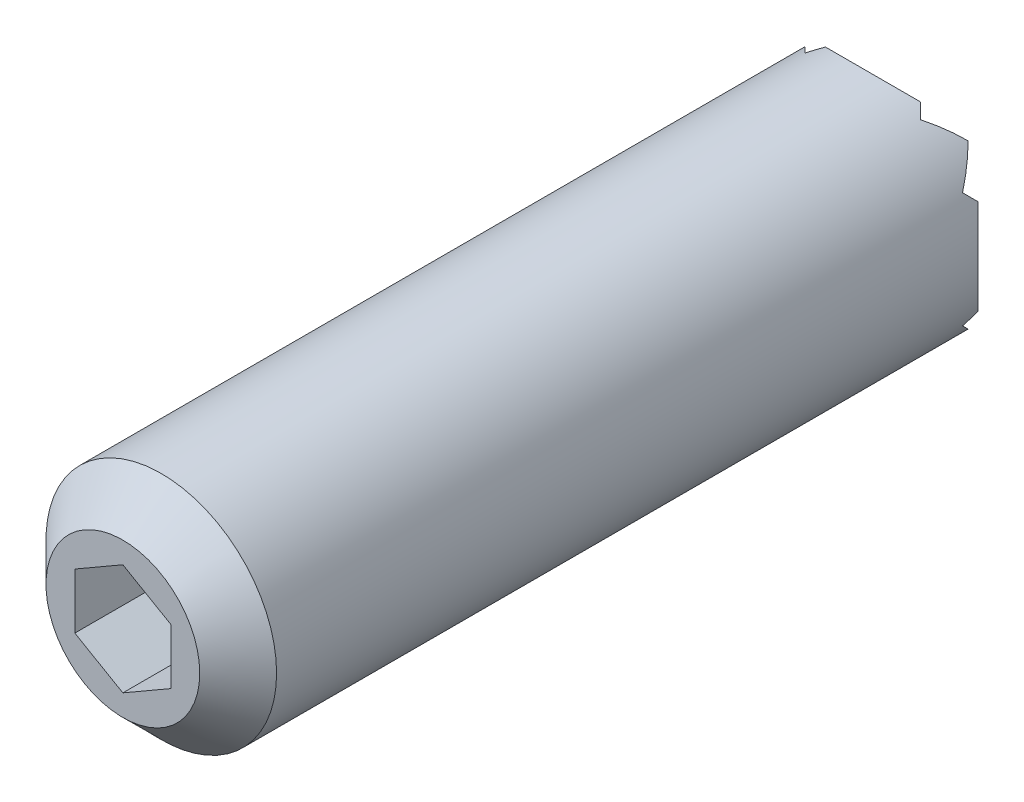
ISO-10303-21;
HEADER;
FILE_DESCRIPTION(('STEP AP214'),'2;1');
FILE_NAME('part.step','',(''),(''),'','','');
FILE_SCHEMA(('AUTOMOTIVE_DESIGN { 1 0 10303 214 1 1 1 1 }'));
ENDSEC;
DATA;
#1=APPLICATION_CONTEXT('core data for automotive mechanical design processes');
#2=APPLICATION_PROTOCOL_DEFINITION('international standard','automotive_design',2000,#1);
#3=PRODUCT_CONTEXT('',#1,'mechanical');
#4=PRODUCT('Part','Part','',(#3));
#5=PRODUCT_RELATED_PRODUCT_CATEGORY('part','',(#4));
#6=PRODUCT_DEFINITION_FORMATION('','',#4);
#7=PRODUCT_DEFINITION_CONTEXT('part definition',#1,'design');
#8=PRODUCT_DEFINITION('design','',#6,#7);
#9=PRODUCT_DEFINITION_SHAPE('','',#8);
#10=(LENGTH_UNIT() NAMED_UNIT(*) SI_UNIT(.MILLI.,.METRE.));
#11=(NAMED_UNIT(*) PLANE_ANGLE_UNIT() SI_UNIT($,.RADIAN.));
#12=(NAMED_UNIT(*) SI_UNIT($,.STERADIAN.) SOLID_ANGLE_UNIT());
#13=UNCERTAINTY_MEASURE_WITH_UNIT(LENGTH_MEASURE(1.E-05),#10,'distance_accuracy_value','');
#14=(GEOMETRIC_REPRESENTATION_CONTEXT(3) GLOBAL_UNCERTAINTY_ASSIGNED_CONTEXT((#13)) GLOBAL_UNIT_ASSIGNED_CONTEXT((#10,
#11,#12)) REPRESENTATION_CONTEXT('',''));
#15=CARTESIAN_POINT('',(0.,0.,0.));
#16=DIRECTION('',(0.,0.,1.));
#17=DIRECTION('',(1.,0.,0.));
#18=AXIS2_PLACEMENT_3D('',#15,#16,#17);
#19=CARTESIAN_POINT('',(2.99999999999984,-10.,1.5));
#20=DIRECTION('',(-0.707106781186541,0.,0.707106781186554));
#21=DIRECTION('',(0.707106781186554,0.,0.707106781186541));
#22=AXIS2_PLACEMENT_3D('',#19,#20,#21);
#23=PLANE('',#22);
#24=CARTESIAN_POINT('',(0.,0.,-1.5));
#25=DIRECTION('',(-0.707106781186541,0.,0.707106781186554));
#26=DIRECTION('',(0.707106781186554,0.,0.707106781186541));
#27=AXIS2_PLACEMENT_3D('',#24,#25,#26);
#28=ELLIPSE('',#27,8.48528137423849,6.);
#29=CARTESIAN_POINT('',(2.99999999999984,-5.19615242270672,1.5));
#30=VERTEX_POINT('',#29);
#31=CARTESIAN_POINT('',(2.46862696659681,-5.46862696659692,0.968626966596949));
#32=VERTEX_POINT('',#31);
#33=EDGE_CURVE('E361',#30,#32,#28,.F.);
#34=ORIENTED_EDGE('',*,*,#33,.T.);
#35=DIRECTION('',(-0.577350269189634,0.577350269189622,-0.577350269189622));
#36=VECTOR('',#35,1.);
#37=CARTESIAN_POINT('',(4.33333333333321,-7.33333333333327,2.8333333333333));
#38=LINE('',#37,#36);
#39=CARTESIAN_POINT('',(1.49999999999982,-4.5,0.));
#40=VERTEX_POINT('',#39);
#41=EDGE_CURVE('E281',#32,#40,#38,.T.);
#42=ORIENTED_EDGE('',*,*,#41,.T.);
#43=DIRECTION('',(0.577350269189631,0.577350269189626,0.57735026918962));
#44=VECTOR('',#43,1.);
#45=CARTESIAN_POINT('',(0.666666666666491,-5.33333333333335,-0.833333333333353));
#46=LINE('',#45,#44);
#47=CARTESIAN_POINT('',(2.99999999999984,-3.,1.5));
#48=VERTEX_POINT('',#47);
#49=EDGE_CURVE('E422',#40,#48,#46,.T.);
#50=ORIENTED_EDGE('',*,*,#49,.T.);
#51=DIRECTION('',(0.,1.,0.));
#52=VECTOR('',#51,1.);
#53=CARTESIAN_POINT('',(2.99999999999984,-10.,1.5));
#54=LINE('',#53,#52);
#55=EDGE_CURVE('E298',#30,#48,#54,.T.);
#56=ORIENTED_EDGE('',*,*,#55,.F.);
#57=EDGE_LOOP('',(#34,#42,#50,#56));
#58=FACE_BOUND('',#57,.T.);
#59=ADVANCED_FACE('F14',(#58),#23,.F.);
#60=CARTESIAN_POINT('',(-1.50000000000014,-10.,0.));
#61=DIRECTION('',(0.707106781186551,0.,0.707106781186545));
#62=DIRECTION('',(0.707106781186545,0.,-0.707106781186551));
#63=AXIS2_PLACEMENT_3D('',#60,#61,#62);
#64=PLANE('',#63);
#65=DIRECTION('',(0.577350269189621,-0.577350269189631,-0.577350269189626));
#66=VECTOR('',#65,1.);
#67=CARTESIAN_POINT('',(0.333333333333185,-6.33333333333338,-1.83333333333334));
#68=LINE('',#67,#66);
#69=CARTESIAN_POINT('',(-3.00000000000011,-3.,1.5));
#70=VERTEX_POINT('',#69);
#71=CARTESIAN_POINT('',(-1.50000000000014,-4.49999999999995,0.));
#72=VERTEX_POINT('',#71);
#73=EDGE_CURVE('E434',#70,#72,#68,.T.);
#74=ORIENTED_EDGE('',*,*,#73,.T.);
#75=DIRECTION('',(-0.577350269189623,-0.577350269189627,0.577350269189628));
#76=VECTOR('',#75,1.);
#77=CARTESIAN_POINT('',(-3.33333333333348,-6.33333333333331,1.83333333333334));
#78=LINE('',#77,#76);
#79=CARTESIAN_POINT('',(-2.46862696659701,-5.46862696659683,0.968626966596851));
#80=VERTEX_POINT('',#79);
#81=EDGE_CURVE('E9',#72,#80,#78,.T.);
#82=ORIENTED_EDGE('',*,*,#81,.T.);
#83=CARTESIAN_POINT('',(0.,0.,-1.5));
#84=DIRECTION('',(0.707106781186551,0.,0.707106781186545));
#85=DIRECTION('',(-0.707106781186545,0.,0.707106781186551));
#86=AXIS2_PLACEMENT_3D('',#83,#84,#85);
#87=ELLIPSE('',#86,8.48528137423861,6.);
#88=CARTESIAN_POINT('',(-3.00000000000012,-5.19615242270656,1.5));
#89=VERTEX_POINT('',#88);
#90=EDGE_CURVE('E365',#80,#89,#87,.F.);
#91=ORIENTED_EDGE('',*,*,#90,.T.);
#92=DIRECTION('',(0.,1.,0.));
#93=VECTOR('',#92,1.);
#94=CARTESIAN_POINT('',(-3.00000000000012,-10.,1.5));
#95=LINE('',#94,#93);
#96=EDGE_CURVE('E293',#89,#70,#95,.T.);
#97=ORIENTED_EDGE('',*,*,#96,.T.);
#98=EDGE_LOOP('',(#74,#82,#91,#97));
#99=FACE_BOUND('',#98,.T.);
#100=ADVANCED_FACE('F564',(#99),#64,.F.);
#101=CARTESIAN_POINT('',(-3.00000000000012,-10.,1.5));
#102=DIRECTION('',(-0.707106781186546,0.,0.707106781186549));
#103=DIRECTION('',(0.707106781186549,0.,0.707106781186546));
#104=AXIS2_PLACEMENT_3D('',#101,#102,#103);
#105=PLANE('',#104);
#106=CARTESIAN_POINT('',(0.,0.,4.5));
#107=DIRECTION('',(-0.707106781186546,0.,0.707106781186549));
#108=DIRECTION('',(0.707106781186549,0.,0.707106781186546));
#109=AXIS2_PLACEMENT_3D('',#106,#107,#108);
#110=ELLIPSE('',#109,8.48528137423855,6.);
#111=CARTESIAN_POINT('',(-4.24264068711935,-4.24264068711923,0.257359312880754));
#112=VERTEX_POINT('',#111);
#113=EDGE_CURVE('E367',#89,#112,#110,.F.);
#114=ORIENTED_EDGE('',*,*,#113,.T.);
#115=DIRECTION('',(0.577350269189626,0.577350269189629,0.577350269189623));
#116=VECTOR('',#115,1.);
#117=CARTESIAN_POINT('',(-5.33333333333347,-5.33333333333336,-0.833333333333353));
#118=LINE('',#117,#116);
#119=EDGE_CURVE('E436',#112,#70,#118,.T.);
#120=ORIENTED_EDGE('',*,*,#119,.T.);
#121=ORIENTED_EDGE('',*,*,#96,.F.);
#122=EDGE_LOOP('',(#114,#120,#121));
#123=FACE_BOUND('',#122,.T.);
#124=ADVANCED_FACE('F558',(#123),#105,.F.);
#125=CARTESIAN_POINT('',(-4.50000000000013,-10.,0.));
#126=DIRECTION('',(0.707106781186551,0.,0.707106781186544));
#127=DIRECTION('',(0.707106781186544,0.,-0.707106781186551));
#128=AXIS2_PLACEMENT_3D('',#125,#126,#127);
#129=PLANE('',#128);
#130=CARTESIAN_POINT('',(0.,0.,-4.5));
#131=DIRECTION('',(0.707106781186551,0.,0.707106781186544));
#132=DIRECTION('',(-0.707106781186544,0.,0.707106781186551));
#133=AXIS2_PLACEMENT_3D('',#130,#131,#132);
#134=ELLIPSE('',#133,8.48528137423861,6.);
#135=CARTESIAN_POINT('',(-6.00000000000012,0.,1.5));
#136=VERTEX_POINT('',#135);
#137=CARTESIAN_POINT('',(-5.46862696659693,2.46862696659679,0.968626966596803));
#138=VERTEX_POINT('',#137);
#139=EDGE_CURVE('E371',#136,#138,#134,.F.);
#140=ORIENTED_EDGE('',*,*,#139,.T.);
#141=DIRECTION('',(0.57735026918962,-0.577350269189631,-0.577350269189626));
#142=VECTOR('',#141,1.);
#143=CARTESIAN_POINT('',(-0.666666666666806,-2.33333333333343,-3.83333333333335));
#144=LINE('',#143,#142);
#145=CARTESIAN_POINT('',(-4.50000000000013,1.5,0.));
#146=VERTEX_POINT('',#145);
#147=EDGE_CURVE('E249',#138,#146,#144,.T.);
#148=ORIENTED_EDGE('',*,*,#147,.T.);
#149=DIRECTION('',(-0.577350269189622,-0.577350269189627,0.577350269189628));
#150=VECTOR('',#149,1.);
#151=CARTESIAN_POINT('',(-8.33333333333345,-2.33333333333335,3.83333333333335));
#152=LINE('',#151,#150);
#153=EDGE_CURVE('E498',#146,#136,#152,.T.);
#154=ORIENTED_EDGE('',*,*,#153,.T.);
#155=EDGE_LOOP('',(#140,#148,#154));
#156=FACE_BOUND('',#155,.T.);
#157=ADVANCED_FACE('F680',(#156),#129,.F.);
#158=CARTESIAN_POINT('',(5.99999999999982,-10.,1.5));
#159=DIRECTION('',(-0.707106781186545,0.,0.70710678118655));
#160=DIRECTION('',(0.70710678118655,0.,0.707106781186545));
#161=AXIS2_PLACEMENT_3D('',#158,#159,#160);
#162=PLANE('',#161);
#163=DIRECTION('',(-0.577350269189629,0.577350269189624,-0.577350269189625));
#164=VECTOR('',#163,1.);
#165=CARTESIAN_POINT('',(9.33333333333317,-3.33333333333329,4.8333333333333));
#166=LINE('',#165,#164);
#167=CARTESIAN_POINT('',(5.99999999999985,0.,1.5));
#168=VERTEX_POINT('',#167);
#169=CARTESIAN_POINT('',(4.4999999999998,1.49999999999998,0.));
#170=VERTEX_POINT('',#169);
#171=EDGE_CURVE('E480',#168,#170,#166,.T.);
#172=ORIENTED_EDGE('',*,*,#171,.T.);
#173=DIRECTION('',(0.577350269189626,0.577350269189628,0.577350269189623));
#174=VECTOR('',#173,1.);
#175=CARTESIAN_POINT('',(1.66666666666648,-1.3333333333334,-2.83333333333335));
#176=LINE('',#175,#174);
#177=CARTESIAN_POINT('',(5.46862696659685,2.46862696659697,0.968626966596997));
#178=VERTEX_POINT('',#177);
#179=EDGE_CURVE('E246',#170,#178,#176,.T.);
#180=ORIENTED_EDGE('',*,*,#179,.T.);
#181=CARTESIAN_POINT('',(0.,0.,-4.5));
#182=DIRECTION('',(-0.707106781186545,0.,0.70710678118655));
#183=DIRECTION('',(0.70710678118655,0.,0.707106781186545));
#184=AXIS2_PLACEMENT_3D('',#181,#182,#183);
#185=ELLIPSE('',#184,8.48528137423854,6.);
#186=EDGE_CURVE('E237',#178,#168,#185,.F.);
#187=ORIENTED_EDGE('',*,*,#186,.T.);
#188=EDGE_LOOP('',(#172,#180,#187));
#189=FACE_BOUND('',#188,.T.);
#190=ADVANCED_FACE('F501',(#189),#162,.F.);
#191=CARTESIAN_POINT('',(4.49999999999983,-10.,0.));
#192=DIRECTION('',(0.707106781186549,0.,0.707106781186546));
#193=DIRECTION('',(0.707106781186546,0.,-0.707106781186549));
#194=AXIS2_PLACEMENT_3D('',#191,#192,#193);
#195=PLANE('',#194);
#196=ORIENTED_EDGE('',*,*,#55,.T.);
#197=DIRECTION('',(0.577350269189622,-0.577350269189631,-0.577350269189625));
#198=VECTOR('',#197,1.);
#199=CARTESIAN_POINT('',(6.33333333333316,-6.33333333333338,-1.83333333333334));
#200=LINE('',#199,#198);
#201=CARTESIAN_POINT('',(4.24264068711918,-4.24264068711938,0.257359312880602));
#202=VERTEX_POINT('',#201);
#203=EDGE_CURVE('E386',#48,#202,#200,.T.);
#204=ORIENTED_EDGE('',*,*,#203,.T.);
#205=CARTESIAN_POINT('',(0.,0.,4.5));
#206=DIRECTION('',(0.707106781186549,0.,0.707106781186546));
#207=DIRECTION('',(-0.707106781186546,0.,0.707106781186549));
#208=AXIS2_PLACEMENT_3D('',#205,#206,#207);
#209=ELLIPSE('',#208,8.48528137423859,6.);
#210=EDGE_CURVE('E355',#202,#30,#209,.F.);
#211=ORIENTED_EDGE('',*,*,#210,.T.);
#212=EDGE_LOOP('',(#196,#204,#211));
#213=FACE_BOUND('',#212,.T.);
#214=ADVANCED_FACE('F665',(#213),#195,.F.);
#215=CARTESIAN_POINT('',(0.,0.,60.));
#216=DIRECTION('',(0.,0.,1.));
#217=DIRECTION('',(1.,0.,0.));
#218=AXIS2_PLACEMENT_3D('',#215,#216,#217);
#219=CYLINDRICAL_SURFACE('',#218,6.);
#220=CARTESIAN_POINT('',(0.,0.,-1.5));
#221=DIRECTION('',(0.,0.707106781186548,0.707106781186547));
#222=DIRECTION('',(0.,-0.707106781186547,0.707106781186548));
#223=AXIS2_PLACEMENT_3D('',#220,#221,#222);
#224=ELLIPSE('',#223,8.48528137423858,6.);
#225=CARTESIAN_POINT('',(5.46862696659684,-2.46862696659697,0.968626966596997));
#226=VERTEX_POINT('',#225);
#227=CARTESIAN_POINT('',(5.19615242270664,-3.,1.5));
#228=VERTEX_POINT('',#227);
#229=EDGE_CURVE('E445',#226,#228,#224,.F.);
#230=ORIENTED_EDGE('',*,*,#229,.F.);
#231=EDGE_CURVE('E357',#168,#226,#185,.F.);
#232=ORIENTED_EDGE('',*,*,#231,.F.);
#233=ORIENTED_EDGE('',*,*,#186,.F.);
#234=CARTESIAN_POINT('',(0.,0.,-1.5));
#235=DIRECTION('',(0.,-0.707106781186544,0.707106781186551));
#236=DIRECTION('',(0.,0.707106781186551,0.707106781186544));
#237=AXIS2_PLACEMENT_3D('',#234,#235,#236);
#238=ELLIPSE('',#237,8.48528137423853,6.);
#239=CARTESIAN_POINT('',(5.19615242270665,3.,1.5));
#240=VERTEX_POINT('',#239);
#241=EDGE_CURVE('E223',#240,#178,#238,.F.);
#242=ORIENTED_EDGE('',*,*,#241,.F.);
#243=CARTESIAN_POINT('',(0.,0.,4.5));
#244=DIRECTION('',(0.,0.707106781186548,0.707106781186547));
#245=DIRECTION('',(0.,-0.707106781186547,0.707106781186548));
#246=AXIS2_PLACEMENT_3D('',#243,#244,#245);
#247=ELLIPSE('',#246,8.48528137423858,6.);
#248=CARTESIAN_POINT('',(4.24264068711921,4.24264068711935,0.257359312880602));
#249=VERTEX_POINT('',#248);
#250=EDGE_CURVE('E205',#249,#240,#247,.F.);
#251=ORIENTED_EDGE('',*,*,#250,.F.);
#252=CARTESIAN_POINT('',(2.99999999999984,5.19615242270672,1.5));
#253=VERTEX_POINT('',#252);
#254=EDGE_CURVE('E358',#253,#249,#209,.F.);
#255=ORIENTED_EDGE('',*,*,#254,.F.);
#256=CARTESIAN_POINT('',(2.4686269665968,5.46862696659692,0.968626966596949));
#257=VERTEX_POINT('',#256);
#258=EDGE_CURVE('E364',#257,#253,#28,.F.);
#259=ORIENTED_EDGE('',*,*,#258,.F.);
#260=CARTESIAN_POINT('',(0.,0.,-4.5));
#261=DIRECTION('',(0.,-0.707106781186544,0.707106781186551));
#262=DIRECTION('',(0.,0.707106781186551,0.707106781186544));
#263=AXIS2_PLACEMENT_3D('',#260,#261,#262);
#264=ELLIPSE('',#263,8.48528137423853,6.);
#265=CARTESIAN_POINT('',(-1.61329283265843E-13,6.,1.5));
#266=VERTEX_POINT('',#265);
#267=EDGE_CURVE('E276',#266,#257,#264,.F.);
#268=ORIENTED_EDGE('',*,*,#267,.F.);
#269=CARTESIAN_POINT('',(-2.46862696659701,5.46862696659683,0.968626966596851));
#270=VERTEX_POINT('',#269);
#271=EDGE_CURVE('E273',#270,#266,#264,.F.);
#272=ORIENTED_EDGE('',*,*,#271,.F.);
#273=CARTESIAN_POINT('',(-3.00000000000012,5.19615242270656,1.5));
#274=VERTEX_POINT('',#273);
#275=EDGE_CURVE('E368',#274,#270,#87,.F.);
#276=ORIENTED_EDGE('',*,*,#275,.F.);
#277=CARTESIAN_POINT('',(-4.24264068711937,4.2426406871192,0.257359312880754));
#278=VERTEX_POINT('',#277);
#279=EDGE_CURVE('E372',#278,#274,#110,.F.);
#280=ORIENTED_EDGE('',*,*,#279,.F.);
#281=CARTESIAN_POINT('',(-5.19615242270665,3.,1.5));
#282=VERTEX_POINT('',#281);
#283=EDGE_CURVE('E219',#282,#278,#247,.F.);
#284=ORIENTED_EDGE('',*,*,#283,.F.);
#285=EDGE_CURVE('E241',#138,#282,#238,.F.);
#286=ORIENTED_EDGE('',*,*,#285,.F.);
#287=ORIENTED_EDGE('',*,*,#139,.F.);
#288=CARTESIAN_POINT('',(-5.46862696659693,-2.46862696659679,0.968626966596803));
#289=VERTEX_POINT('',#288);
#290=EDGE_CURVE('E374',#289,#136,#134,.F.);
#291=ORIENTED_EDGE('',*,*,#290,.F.);
#292=CARTESIAN_POINT('',(-5.19615242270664,-3.,1.5));
#293=VERTEX_POINT('',#292);
#294=EDGE_CURVE('E447',#293,#289,#224,.F.);
#295=ORIENTED_EDGE('',*,*,#294,.F.);
#296=CARTESIAN_POINT('',(0.,0.,4.5));
#297=DIRECTION('',(0.,-0.707106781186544,0.707106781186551));
#298=DIRECTION('',(0.,0.707106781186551,0.707106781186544));
#299=AXIS2_PLACEMENT_3D('',#296,#297,#298);
#300=ELLIPSE('',#299,8.48528137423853,6.);
#301=EDGE_CURVE('E428',#112,#293,#300,.F.);
#302=ORIENTED_EDGE('',*,*,#301,.F.);
#303=ORIENTED_EDGE('',*,*,#113,.F.);
#304=ORIENTED_EDGE('',*,*,#90,.F.);
#305=CARTESIAN_POINT('',(0.,0.,-4.5));
#306=DIRECTION('',(0.,0.707106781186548,0.707106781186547));
#307=DIRECTION('',(0.,-0.707106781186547,0.707106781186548));
#308=AXIS2_PLACEMENT_3D('',#305,#306,#307);
#309=ELLIPSE('',#308,8.48528137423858,6.);
#310=CARTESIAN_POINT('',(-1.31730563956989E-13,-6.,1.5));
#311=VERTEX_POINT('',#310);
#312=EDGE_CURVE('E286',#311,#80,#309,.F.);
#313=ORIENTED_EDGE('',*,*,#312,.F.);
#314=EDGE_CURVE('E284',#32,#311,#309,.F.);
#315=ORIENTED_EDGE('',*,*,#314,.F.);
#316=ORIENTED_EDGE('',*,*,#33,.F.);
#317=ORIENTED_EDGE('',*,*,#210,.F.);
#318=EDGE_CURVE('E425',#228,#202,#300,.F.);
#319=ORIENTED_EDGE('',*,*,#318,.F.);
#320=EDGE_LOOP('',(#230,#232,#233,#242,#251,#255,#259,#268,#272,#276,#280,#284,#286,#287,#291,
#295,#302,#303,#304,#313,#315,#316,#317,#319));
#321=FACE_BOUND('',#320,.T.);
#322=CARTESIAN_POINT('',(0.,0.,38.));
#323=DIRECTION('',(0.,0.,1.));
#324=DIRECTION('',(1.,0.,0.));
#325=AXIS2_PLACEMENT_3D('',#322,#323,#324);
#326=CIRCLE('',#325,6.);
#327=CARTESIAN_POINT('',(6.,0.,38.));
#328=VERTEX_POINT('',#327);
#329=EDGE_CURVE('E352',#328,#328,#326,.F.);
#330=ORIENTED_EDGE('',*,*,#329,.T.);
#331=EDGE_LOOP('',(#330));
#332=FACE_BOUND('',#331,.T.);
#333=ADVANCED_FACE('F233',(#321,#332),#219,.T.);
#334=CARTESIAN_POINT('',(0.,0.,40.));
#335=DIRECTION('',(0.,0.,1.));
#336=DIRECTION('',(1.,0.,0.));
#337=AXIS2_PLACEMENT_3D('',#334,#335,#336);
#338=PLANE('',#337);
#339=CARTESIAN_POINT('',(0.,0.,40.));
#340=DIRECTION('',(0.,0.,1.));
#341=DIRECTION('',(1.,0.,0.));
#342=AXIS2_PLACEMENT_3D('',#339,#340,#341);
#343=CIRCLE('',#342,4.);
#344=CARTESIAN_POINT('',(4.,0.,40.));
#345=VERTEX_POINT('',#344);
#346=EDGE_CURVE('E349',#345,#345,#343,.T.);
#347=ORIENTED_EDGE('',*,*,#346,.T.);
#348=EDGE_LOOP('',(#347));
#349=FACE_BOUND('',#348,.T.);
#350=DIRECTION('',(0.86602540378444,-0.5,0.));
#351=VECTOR('',#350,1.);
#352=CARTESIAN_POINT('',(-2.5,-1.44337567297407,40.));
#353=LINE('',#352,#351);
#354=CARTESIAN_POINT('',(-2.5,-1.44337567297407,40.));
#355=VERTEX_POINT('',#354);
#356=CARTESIAN_POINT('',(0.,-2.88675134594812,40.));
#357=VERTEX_POINT('',#356);
#358=EDGE_CURVE('E290',#355,#357,#353,.T.);
#359=ORIENTED_EDGE('',*,*,#358,.F.);
#360=DIRECTION('',(0.,-1.,0.));
#361=VECTOR('',#360,1.);
#362=CARTESIAN_POINT('',(-2.5,1.44337567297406,40.));
#363=LINE('',#362,#361);
#364=CARTESIAN_POINT('',(-2.5,1.44337567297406,40.));
#365=VERTEX_POINT('',#364);
#366=EDGE_CURVE('E315',#365,#355,#363,.T.);
#367=ORIENTED_EDGE('',*,*,#366,.F.);
#368=DIRECTION('',(0.866025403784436,0.5,0.));
#369=VECTOR('',#368,1.);
#370=CARTESIAN_POINT('',(-2.5,1.44337567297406,40.));
#371=LINE('',#370,#369);
#372=CARTESIAN_POINT('',(0.,2.88675134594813,40.));
#373=VERTEX_POINT('',#372);
#374=EDGE_CURVE('E312',#365,#373,#371,.T.);
#375=ORIENTED_EDGE('',*,*,#374,.T.);
#376=DIRECTION('',(-0.866025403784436,0.5,0.));
#377=VECTOR('',#376,1.);
#378=CARTESIAN_POINT('',(2.5,1.44337567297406,40.));
#379=LINE('',#378,#377);
#380=CARTESIAN_POINT('',(2.5,1.44337567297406,40.));
#381=VERTEX_POINT('',#380);
#382=EDGE_CURVE('E309',#381,#373,#379,.T.);
#383=ORIENTED_EDGE('',*,*,#382,.F.);
#384=DIRECTION('',(0.,-1.,0.));
#385=VECTOR('',#384,1.);
#386=CARTESIAN_POINT('',(2.5,1.44337567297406,40.));
#387=LINE('',#386,#385);
#388=CARTESIAN_POINT('',(2.5,-1.44337567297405,40.));
#389=VERTEX_POINT('',#388);
#390=EDGE_CURVE('E306',#381,#389,#387,.T.);
#391=ORIENTED_EDGE('',*,*,#390,.T.);
#392=DIRECTION('',(-0.866025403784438,-0.5,0.));
#393=VECTOR('',#392,1.);
#394=CARTESIAN_POINT('',(2.5,-1.44337567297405,40.));
#395=LINE('',#394,#393);
#396=EDGE_CURVE('E303',#389,#357,#395,.T.);
#397=ORIENTED_EDGE('',*,*,#396,.T.);
#398=EDGE_LOOP('',(#359,#367,#375,#383,#391,#397));
#399=FACE_BOUND('',#398,.T.);
#400=ADVANCED_FACE('F679',(#349,#399),#338,.T.);
#401=CARTESIAN_POINT('',(-2.5,-1.44337567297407,34.));
#402=DIRECTION('',(-0.5,-0.86602540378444,0.));
#403=DIRECTION('',(-0.86602540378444,0.5,0.));
#404=AXIS2_PLACEMENT_3D('',#401,#402,#403);
#405=PLANE('',#404);
#406=DIRECTION('',(0.,0.,1.));
#407=VECTOR('',#406,1.);
#408=CARTESIAN_POINT('',(-2.5,-1.44337567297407,34.));
#409=LINE('',#408,#407);
#410=CARTESIAN_POINT('',(-2.5,-1.44337567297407,34.));
#411=VERTEX_POINT('',#410);
#412=EDGE_CURVE('E347',#411,#355,#409,.T.);
#413=ORIENTED_EDGE('',*,*,#412,.T.);
#414=ORIENTED_EDGE('',*,*,#358,.T.);
#415=DIRECTION('',(0.,0.,1.));
#416=VECTOR('',#415,1.);
#417=CARTESIAN_POINT('',(0.,-2.88675134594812,34.));
#418=LINE('',#417,#416);
#419=CARTESIAN_POINT('',(0.,-2.88675134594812,34.));
#420=VERTEX_POINT('',#419);
#421=EDGE_CURVE('E336',#420,#357,#418,.T.);
#422=ORIENTED_EDGE('',*,*,#421,.F.);
#423=DIRECTION('',(0.86602540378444,-0.5,0.));
#424=VECTOR('',#423,1.);
#425=CARTESIAN_POINT('',(-2.5,-1.44337567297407,34.));
#426=LINE('',#425,#424);
#427=EDGE_CURVE('E318',#411,#420,#426,.T.);
#428=ORIENTED_EDGE('',*,*,#427,.F.);
#429=EDGE_LOOP('',(#413,#414,#422,#428));
#430=FACE_BOUND('',#429,.T.);
#431=ADVANCED_FACE('F1125',(#430),#405,.F.);
#432=CARTESIAN_POINT('',(-2.5,1.44337567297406,34.));
#433=DIRECTION('',(-1.,0.,0.));
#434=DIRECTION('',(0.,1.,0.));
#435=AXIS2_PLACEMENT_3D('',#432,#433,#434);
#436=PLANE('',#435);
#437=DIRECTION('',(0.,0.,1.));
#438=VECTOR('',#437,1.);
#439=CARTESIAN_POINT('',(-2.5,1.44337567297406,34.));
#440=LINE('',#439,#438);
#441=CARTESIAN_POINT('',(-2.5,1.44337567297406,34.));
#442=VERTEX_POINT('',#441);
#443=EDGE_CURVE('E345',#442,#365,#440,.T.);
#444=ORIENTED_EDGE('',*,*,#443,.T.);
#445=ORIENTED_EDGE('',*,*,#366,.T.);
#446=ORIENTED_EDGE('',*,*,#412,.F.);
#447=DIRECTION('',(0.,-1.,0.));
#448=VECTOR('',#447,1.);
#449=CARTESIAN_POINT('',(-2.5,1.44337567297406,34.));
#450=LINE('',#449,#448);
#451=EDGE_CURVE('E333',#442,#411,#450,.T.);
#452=ORIENTED_EDGE('',*,*,#451,.F.);
#453=EDGE_LOOP('',(#444,#445,#446,#452));
#454=FACE_BOUND('',#453,.T.);
#455=ADVANCED_FACE('F1116',(#454),#436,.F.);
#456=CARTESIAN_POINT('',(-2.5,1.44337567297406,34.));
#457=DIRECTION('',(0.5,-0.866025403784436,0.));
#458=DIRECTION('',(-0.866025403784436,-0.5,0.));
#459=AXIS2_PLACEMENT_3D('',#456,#457,#458);
#460=PLANE('',#459);
#461=DIRECTION('',(0.,0.,1.));
#462=VECTOR('',#461,1.);
#463=CARTESIAN_POINT('',(0.,2.88675134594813,34.));
#464=LINE('',#463,#462);
#465=CARTESIAN_POINT('',(0.,2.88675134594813,34.));
#466=VERTEX_POINT('',#465);
#467=EDGE_CURVE('E343',#466,#373,#464,.T.);
#468=ORIENTED_EDGE('',*,*,#467,.T.);
#469=ORIENTED_EDGE('',*,*,#374,.F.);
#470=ORIENTED_EDGE('',*,*,#443,.F.);
#471=DIRECTION('',(0.866025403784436,0.5,0.));
#472=VECTOR('',#471,1.);
#473=CARTESIAN_POINT('',(-2.5,1.44337567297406,34.));
#474=LINE('',#473,#472);
#475=EDGE_CURVE('E330',#442,#466,#474,.T.);
#476=ORIENTED_EDGE('',*,*,#475,.T.);
#477=EDGE_LOOP('',(#468,#469,#470,#476));
#478=FACE_BOUND('',#477,.T.);
#479=ADVANCED_FACE('F1107',(#478),#460,.T.);
#480=CARTESIAN_POINT('',(2.5,1.44337567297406,34.));
#481=DIRECTION('',(0.5,0.866025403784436,0.));
#482=DIRECTION('',(0.866025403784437,-0.5,0.));
#483=AXIS2_PLACEMENT_3D('',#480,#481,#482);
#484=PLANE('',#483);
#485=DIRECTION('',(0.,0.,1.));
#486=VECTOR('',#485,1.);
#487=CARTESIAN_POINT('',(2.5,1.44337567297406,34.));
#488=LINE('',#487,#486);
#489=CARTESIAN_POINT('',(2.5,1.44337567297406,34.));
#490=VERTEX_POINT('',#489);
#491=EDGE_CURVE('E341',#490,#381,#488,.T.);
#492=ORIENTED_EDGE('',*,*,#491,.T.);
#493=ORIENTED_EDGE('',*,*,#382,.T.);
#494=ORIENTED_EDGE('',*,*,#467,.F.);
#495=DIRECTION('',(-0.866025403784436,0.5,0.));
#496=VECTOR('',#495,1.);
#497=CARTESIAN_POINT('',(2.5,1.44337567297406,34.));
#498=LINE('',#497,#496);
#499=EDGE_CURVE('E327',#490,#466,#498,.T.);
#500=ORIENTED_EDGE('',*,*,#499,.F.);
#501=EDGE_LOOP('',(#492,#493,#494,#500));
#502=FACE_BOUND('',#501,.T.);
#503=ADVANCED_FACE('F1098',(#502),#484,.F.);
#504=CARTESIAN_POINT('',(2.5,1.44337567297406,34.));
#505=DIRECTION('',(-1.,0.,0.));
#506=DIRECTION('',(0.,1.,0.));
#507=AXIS2_PLACEMENT_3D('',#504,#505,#506);
#508=PLANE('',#507);
#509=DIRECTION('',(0.,0.,1.));
#510=VECTOR('',#509,1.);
#511=CARTESIAN_POINT('',(2.5,-1.44337567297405,34.));
#512=LINE('',#511,#510);
#513=CARTESIAN_POINT('',(2.5,-1.44337567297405,34.));
#514=VERTEX_POINT('',#513);
#515=EDGE_CURVE('E339',#514,#389,#512,.T.);
#516=ORIENTED_EDGE('',*,*,#515,.T.);
#517=ORIENTED_EDGE('',*,*,#390,.F.);
#518=ORIENTED_EDGE('',*,*,#491,.F.);
#519=DIRECTION('',(0.,-1.,0.));
#520=VECTOR('',#519,1.);
#521=CARTESIAN_POINT('',(2.5,1.44337567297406,34.));
#522=LINE('',#521,#520);
#523=EDGE_CURVE('E324',#490,#514,#522,.T.);
#524=ORIENTED_EDGE('',*,*,#523,.T.);
#525=EDGE_LOOP('',(#516,#517,#518,#524));
#526=FACE_BOUND('',#525,.T.);
#527=ADVANCED_FACE('F1083',(#526),#508,.T.);
#528=CARTESIAN_POINT('',(2.5,-1.44337567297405,34.));
#529=DIRECTION('',(-0.5,0.866025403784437,0.));
#530=DIRECTION('',(0.866025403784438,0.5,0.));
#531=AXIS2_PLACEMENT_3D('',#528,#529,#530);
#532=PLANE('',#531);
#533=DIRECTION('',(-0.866025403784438,-0.5,0.));
#534=VECTOR('',#533,1.);
#535=CARTESIAN_POINT('',(2.5,-1.44337567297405,34.));
#536=LINE('',#535,#534);
#537=EDGE_CURVE('E321',#514,#420,#536,.T.);
#538=ORIENTED_EDGE('',*,*,#537,.T.);
#539=ORIENTED_EDGE('',*,*,#421,.T.);
#540=ORIENTED_EDGE('',*,*,#396,.F.);
#541=ORIENTED_EDGE('',*,*,#515,.F.);
#542=EDGE_LOOP('',(#538,#539,#540,#541));
#543=FACE_BOUND('',#542,.T.);
#544=ADVANCED_FACE('F644',(#543),#532,.T.);
#545=CARTESIAN_POINT('',(-5.,0.,34.));
#546=DIRECTION('',(0.,0.,1.));
#547=DIRECTION('',(1.,0.,0.));
#548=AXIS2_PLACEMENT_3D('',#545,#546,#547);
#549=PLANE('',#548);
#550=ORIENTED_EDGE('',*,*,#427,.T.);
#551=ORIENTED_EDGE('',*,*,#537,.F.);
#552=ORIENTED_EDGE('',*,*,#523,.F.);
#553=ORIENTED_EDGE('',*,*,#499,.T.);
#554=ORIENTED_EDGE('',*,*,#475,.F.);
#555=ORIENTED_EDGE('',*,*,#451,.T.);
#556=EDGE_LOOP('',(#550,#551,#552,#553,#554,#555));
#557=FACE_BOUND('',#556,.T.);
#558=ADVANCED_FACE('F642',(#557),#549,.T.);
#559=CARTESIAN_POINT('',(0.,0.,40.));
#560=DIRECTION('',(0.,0.,-1.));
#561=DIRECTION('',(-1.,0.,0.));
#562=AXIS2_PLACEMENT_3D('',#559,#560,#561);
#563=CONICAL_SURFACE('',#562,4.,0.785398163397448);
#564=ORIENTED_EDGE('',*,*,#329,.F.);
#565=EDGE_LOOP('',(#564));
#566=FACE_BOUND('',#565,.T.);
#567=ORIENTED_EDGE('',*,*,#346,.F.);
#568=EDGE_LOOP('',(#567));
#569=FACE_BOUND('',#568,.T.);
#570=ADVANCED_FACE('F16',(#566,#569),#563,.T.);
#571=DIRECTION('',(-0.577350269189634,0.577350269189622,-0.577350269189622));
#572=VECTOR('',#571,1.);
#573=CARTESIAN_POINT('',(7.3333333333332,-1.33333333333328,5.83333333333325));
#574=LINE('',#573,#572);
#575=CARTESIAN_POINT('',(2.99999999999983,3.,1.5));
#576=VERTEX_POINT('',#575);
#577=CARTESIAN_POINT('',(1.49999999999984,4.5,0.));
#578=VERTEX_POINT('',#577);
#579=EDGE_CURVE('E217',#576,#578,#574,.T.);
#580=ORIENTED_EDGE('',*,*,#579,.T.);
#581=DIRECTION('',(0.577350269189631,0.577350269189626,0.57735026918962));
#582=VECTOR('',#581,1.);
#583=CARTESIAN_POINT('',(-2.33333333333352,0.666666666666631,-3.8333333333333));
#584=LINE('',#583,#582);
#585=EDGE_CURVE('E270',#578,#257,#584,.T.);
#586=ORIENTED_EDGE('',*,*,#585,.T.);
#587=ORIENTED_EDGE('',*,*,#258,.T.);
#588=EDGE_CURVE('E301',#576,#253,#54,.T.);
#589=ORIENTED_EDGE('',*,*,#588,.F.);
#590=EDGE_LOOP('',(#580,#586,#587,#589));
#591=FACE_BOUND('',#590,.T.);
#592=ADVANCED_FACE('F624',(#591),#23,.F.);
#593=ORIENTED_EDGE('',*,*,#275,.T.);
#594=DIRECTION('',(0.577350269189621,-0.577350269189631,-0.577350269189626));
#595=VECTOR('',#594,1.);
#596=CARTESIAN_POINT('',(3.33333333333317,-0.333333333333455,-4.8333333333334));
#597=LINE('',#596,#595);
#598=CARTESIAN_POINT('',(-1.50000000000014,4.5,0.));
#599=VERTEX_POINT('',#598);
#600=EDGE_CURVE('E22',#270,#599,#597,.T.);
#601=ORIENTED_EDGE('',*,*,#600,.T.);
#602=DIRECTION('',(-0.577350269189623,-0.577350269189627,0.577350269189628));
#603=VECTOR('',#602,1.);
#604=CARTESIAN_POINT('',(-6.33333333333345,-0.333333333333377,4.83333333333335));
#605=LINE('',#604,#603);
#606=CARTESIAN_POINT('',(-3.00000000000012,3.,1.5));
#607=VERTEX_POINT('',#606);
#608=EDGE_CURVE('E393',#599,#607,#605,.T.);
#609=ORIENTED_EDGE('',*,*,#608,.T.);
#610=EDGE_CURVE('E297',#607,#274,#95,.T.);
#611=ORIENTED_EDGE('',*,*,#610,.T.);
#612=EDGE_LOOP('',(#593,#601,#609,#611));
#613=FACE_BOUND('',#612,.T.);
#614=ADVANCED_FACE('F392',(#613),#64,.F.);
#615=ORIENTED_EDGE('',*,*,#610,.F.);
#616=DIRECTION('',(-0.577350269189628,0.577350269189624,-0.577350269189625));
#617=VECTOR('',#616,1.);
#618=CARTESIAN_POINT('',(1.3333333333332,-1.33333333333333,5.8333333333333));
#619=LINE('',#618,#617);
#620=EDGE_CURVE('E407',#607,#278,#619,.T.);
#621=ORIENTED_EDGE('',*,*,#620,.T.);
#622=ORIENTED_EDGE('',*,*,#279,.T.);
#623=EDGE_LOOP('',(#615,#621,#622));
#624=FACE_BOUND('',#623,.T.);
#625=ADVANCED_FACE('F640',(#624),#105,.F.);
#626=ORIENTED_EDGE('',*,*,#290,.T.);
#627=DIRECTION('',(0.57735026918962,-0.577350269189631,-0.577350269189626));
#628=VECTOR('',#627,1.);
#629=CARTESIAN_POINT('',(-1.6666666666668,-4.3333333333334,-2.83333333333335));
#630=LINE('',#629,#628);
#631=CARTESIAN_POINT('',(-4.50000000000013,-1.49999999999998,0.));
#632=VERTEX_POINT('',#631);
#633=EDGE_CURVE('E478',#136,#632,#630,.T.);
#634=ORIENTED_EDGE('',*,*,#633,.T.);
#635=DIRECTION('',(-0.577350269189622,-0.577350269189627,0.577350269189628));
#636=VECTOR('',#635,1.);
#637=CARTESIAN_POINT('',(-7.33333333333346,-4.33333333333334,2.83333333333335));
#638=LINE('',#637,#636);
#639=EDGE_CURVE('E458',#632,#289,#638,.T.);
#640=ORIENTED_EDGE('',*,*,#639,.T.);
#641=EDGE_LOOP('',(#626,#634,#640));
#642=FACE_BOUND('',#641,.T.);
#643=ADVANCED_FACE('F791',(#642),#129,.F.);
#644=DIRECTION('',(-0.577350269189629,0.577350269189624,-0.577350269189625));
#645=VECTOR('',#644,1.);
#646=CARTESIAN_POINT('',(8.33333333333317,-5.33333333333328,3.8333333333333));
#647=LINE('',#646,#645);
#648=CARTESIAN_POINT('',(4.49999999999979,-1.5,0.));
#649=VERTEX_POINT('',#648);
#650=EDGE_CURVE('E439',#226,#649,#647,.T.);
#651=ORIENTED_EDGE('',*,*,#650,.T.);
#652=DIRECTION('',(0.577350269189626,0.577350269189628,0.577350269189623));
#653=VECTOR('',#652,1.);
#654=CARTESIAN_POINT('',(2.66666666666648,-3.33333333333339,-1.83333333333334));
#655=LINE('',#654,#653);
#656=EDGE_CURVE('E461',#649,#168,#655,.T.);
#657=ORIENTED_EDGE('',*,*,#656,.T.);
#658=ORIENTED_EDGE('',*,*,#231,.T.);
#659=EDGE_LOOP('',(#651,#657,#658));
#660=FACE_BOUND('',#659,.T.);
#661=ADVANCED_FACE('F663',(#660),#162,.F.);
#662=ORIENTED_EDGE('',*,*,#254,.T.);
#663=DIRECTION('',(-0.577350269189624,-0.577350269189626,0.577350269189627));
#664=VECTOR('',#663,1.);
#665=CARTESIAN_POINT('',(-0.333333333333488,-0.333333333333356,4.8333333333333));
#666=LINE('',#665,#664);
#667=EDGE_CURVE('E211',#249,#576,#666,.T.);
#668=ORIENTED_EDGE('',*,*,#667,.T.);
#669=ORIENTED_EDGE('',*,*,#588,.T.);
#670=EDGE_LOOP('',(#662,#668,#669));
#671=FACE_BOUND('',#670,.T.);
#672=ADVANCED_FACE('F655',(#671),#195,.F.);
#673=CARTESIAN_POINT('',(10.,4.5,0.));
#674=DIRECTION('',(0.,0.707106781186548,0.707106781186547));
#675=DIRECTION('',(0.,0.707106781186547,-0.707106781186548));
#676=AXIS2_PLACEMENT_3D('',#673,#674,#675);
#677=PLANE('',#676);
#678=ORIENTED_EDGE('',*,*,#250,.T.);
#679=DIRECTION('',(-1.,0.,0.));
#680=VECTOR('',#679,1.);
#681=CARTESIAN_POINT('',(10.,3.,1.5));
#682=LINE('',#681,#680);
#683=EDGE_CURVE('E208',#240,#576,#682,.T.);
#684=ORIENTED_EDGE('',*,*,#683,.T.);
#685=ORIENTED_EDGE('',*,*,#667,.F.);
#686=EDGE_LOOP('',(#678,#684,#685));
#687=FACE_BOUND('',#686,.T.);
#688=ADVANCED_FACE('F207',(#687),#677,.F.);
#689=CARTESIAN_POINT('',(10.,3.,1.5));
#690=DIRECTION('',(0.,-0.707106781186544,0.707106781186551));
#691=DIRECTION('',(0.,0.707106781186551,0.707106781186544));
#692=AXIS2_PLACEMENT_3D('',#689,#690,#691);
#693=PLANE('',#692);
#694=ORIENTED_EDGE('',*,*,#241,.T.);
#695=ORIENTED_EDGE('',*,*,#179,.F.);
#696=DIRECTION('',(0.577350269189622,-0.577350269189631,-0.577350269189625));
#697=VECTOR('',#696,1.);
#698=CARTESIAN_POINT('',(8.33333333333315,-2.33333333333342,-3.83333333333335));
#699=LINE('',#698,#697);
#700=EDGE_CURVE('E226',#576,#170,#699,.T.);
#701=ORIENTED_EDGE('',*,*,#700,.F.);
#702=ORIENTED_EDGE('',*,*,#683,.F.);
#703=EDGE_LOOP('',(#694,#695,#701,#702));
#704=FACE_BOUND('',#703,.T.);
#705=ADVANCED_FACE('F221',(#704),#693,.F.);
#706=CARTESIAN_POINT('',(10.,-3.,1.5));
#707=DIRECTION('',(0.,-0.707106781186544,0.707106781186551));
#708=DIRECTION('',(0.,0.707106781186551,0.707106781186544));
#709=AXIS2_PLACEMENT_3D('',#706,#707,#708);
#710=PLANE('',#709);
#711=ORIENTED_EDGE('',*,*,#318,.T.);
#712=ORIENTED_EDGE('',*,*,#203,.F.);
#713=DIRECTION('',(-1.,0.,0.));
#714=VECTOR('',#713,1.);
#715=CARTESIAN_POINT('',(10.,-3.,1.5));
#716=LINE('',#715,#714);
#717=EDGE_CURVE('E532',#228,#48,#716,.T.);
#718=ORIENTED_EDGE('',*,*,#717,.F.);
#719=EDGE_LOOP('',(#711,#712,#718));
#720=FACE_BOUND('',#719,.T.);
#721=ADVANCED_FACE('F671',(#720),#710,.F.);
#722=CARTESIAN_POINT('',(10.,-1.5,0.));
#723=DIRECTION('',(0.,0.707106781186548,0.707106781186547));
#724=DIRECTION('',(0.,0.707106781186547,-0.707106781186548));
#725=AXIS2_PLACEMENT_3D('',#722,#723,#724);
#726=PLANE('',#725);
#727=ORIENTED_EDGE('',*,*,#229,.T.);
#728=ORIENTED_EDGE('',*,*,#717,.T.);
#729=DIRECTION('',(-0.577350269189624,-0.577350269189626,0.577350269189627));
#730=VECTOR('',#729,1.);
#731=CARTESIAN_POINT('',(1.66666666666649,-4.33333333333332,2.8333333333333));
#732=LINE('',#731,#730);
#733=EDGE_CURVE('E383',#649,#48,#732,.T.);
#734=ORIENTED_EDGE('',*,*,#733,.F.);
#735=ORIENTED_EDGE('',*,*,#650,.F.);
#736=EDGE_LOOP('',(#727,#728,#734,#735));
#737=FACE_BOUND('',#736,.T.);
#738=ADVANCED_FACE('F653',(#737),#726,.F.);
#739=DIRECTION('',(0.577350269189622,-0.577350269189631,-0.577350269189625));
#740=VECTOR('',#739,1.);
#741=CARTESIAN_POINT('',(7.33333333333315,-4.3333333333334,-2.83333333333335));
#742=LINE('',#741,#740);
#743=CARTESIAN_POINT('',(2.99999999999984,0.,1.5));
#744=VERTEX_POINT('',#743);
#745=EDGE_CURVE('E380',#744,#649,#742,.T.);
#746=ORIENTED_EDGE('',*,*,#745,.T.);
#747=ORIENTED_EDGE('',*,*,#733,.T.);
#748=EDGE_CURVE('E300',#48,#744,#54,.T.);
#749=ORIENTED_EDGE('',*,*,#748,.T.);
#750=EDGE_LOOP('',(#746,#747,#749));
#751=FACE_BOUND('',#750,.T.);
#752=ADVANCED_FACE('F633',(#751),#195,.F.);
#753=ORIENTED_EDGE('',*,*,#748,.F.);
#754=DIRECTION('',(-0.577350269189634,0.577350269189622,-0.577350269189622));
#755=VECTOR('',#754,1.);
#756=CARTESIAN_POINT('',(5.3333333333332,-5.33333333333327,3.8333333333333));
#757=LINE('',#756,#755);
#758=CARTESIAN_POINT('',(1.49999999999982,-1.5,0.));
#759=VERTEX_POINT('',#758);
#760=EDGE_CURVE('E442',#48,#759,#757,.T.);
#761=ORIENTED_EDGE('',*,*,#760,.T.);
#762=DIRECTION('',(0.577350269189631,0.577350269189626,0.57735026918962));
#763=VECTOR('',#762,1.);
#764=CARTESIAN_POINT('',(-0.333333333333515,-3.33333333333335,-1.83333333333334));
#765=LINE('',#764,#763);
#766=EDGE_CURVE('E464',#759,#744,#765,.T.);
#767=ORIENTED_EDGE('',*,*,#766,.T.);
#768=EDGE_LOOP('',(#753,#761,#767));
#769=FACE_BOUND('',#768,.T.);
#770=ADVANCED_FACE('F623',(#769),#23,.F.);
#771=CARTESIAN_POINT('',(10.,0.,1.5));
#772=DIRECTION('',(0.,-0.707106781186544,0.707106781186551));
#773=DIRECTION('',(0.,0.707106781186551,0.707106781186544));
#774=AXIS2_PLACEMENT_3D('',#771,#772,#773);
#775=PLANE('',#774);
#776=ORIENTED_EDGE('',*,*,#745,.F.);
#777=DIRECTION('',(-1.,0.,0.));
#778=VECTOR('',#777,1.);
#779=CARTESIAN_POINT('',(10.,0.,1.5));
#780=LINE('',#779,#778);
#781=EDGE_CURVE('E523',#168,#744,#780,.T.);
#782=ORIENTED_EDGE('',*,*,#781,.F.);
#783=ORIENTED_EDGE('',*,*,#656,.F.);
#784=EDGE_LOOP('',(#776,#782,#783));
#785=FACE_BOUND('',#784,.T.);
#786=ADVANCED_FACE('F632',(#785),#775,.F.);
#787=CARTESIAN_POINT('',(10.,1.49999999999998,0.));
#788=DIRECTION('',(0.,0.707106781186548,0.707106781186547));
#789=DIRECTION('',(0.,0.707106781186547,-0.707106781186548));
#790=AXIS2_PLACEMENT_3D('',#787,#788,#789);
#791=PLANE('',#790);
#792=ORIENTED_EDGE('',*,*,#781,.T.);
#793=DIRECTION('',(-0.577350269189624,-0.577350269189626,0.577350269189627));
#794=VECTOR('',#793,1.);
#795=CARTESIAN_POINT('',(0.666666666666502,-2.33333333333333,3.8333333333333));
#796=LINE('',#795,#794);
#797=EDGE_CURVE('E377',#170,#744,#796,.T.);
#798=ORIENTED_EDGE('',*,*,#797,.F.);
#799=ORIENTED_EDGE('',*,*,#171,.F.);
#800=EDGE_LOOP('',(#792,#798,#799));
#801=FACE_BOUND('',#800,.T.);
#802=ADVANCED_FACE('F654',(#801),#791,.F.);
#803=ORIENTED_EDGE('',*,*,#700,.T.);
#804=ORIENTED_EDGE('',*,*,#797,.T.);
#805=EDGE_CURVE('E509',#744,#576,#54,.T.);
#806=ORIENTED_EDGE('',*,*,#805,.T.);
#807=EDGE_LOOP('',(#803,#804,#806));
#808=FACE_BOUND('',#807,.T.);
#809=ADVANCED_FACE('F507',(#808),#195,.F.);
#810=ORIENTED_EDGE('',*,*,#805,.F.);
#811=DIRECTION('',(-0.577350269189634,0.577350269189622,-0.577350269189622));
#812=VECTOR('',#811,1.);
#813=CARTESIAN_POINT('',(6.3333333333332,-3.33333333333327,4.83333333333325));
#814=LINE('',#813,#812);
#815=CARTESIAN_POINT('',(1.49999999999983,1.49999999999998,0.));
#816=VERTEX_POINT('',#815);
#817=EDGE_CURVE('E483',#744,#816,#814,.T.);
#818=ORIENTED_EDGE('',*,*,#817,.T.);
#819=DIRECTION('',(0.577350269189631,0.577350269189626,0.57735026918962));
#820=VECTOR('',#819,1.);
#821=CARTESIAN_POINT('',(-1.33333333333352,-1.33333333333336,-2.8333333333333));
#822=LINE('',#821,#820);
#823=EDGE_CURVE('E239',#816,#576,#822,.T.);
#824=ORIENTED_EDGE('',*,*,#823,.T.);
#825=EDGE_LOOP('',(#810,#818,#824));
#826=FACE_BOUND('',#825,.T.);
#827=ADVANCED_FACE('F512',(#826),#23,.F.);
#828=ORIENTED_EDGE('',*,*,#294,.T.);
#829=ORIENTED_EDGE('',*,*,#639,.F.);
#830=DIRECTION('',(-0.577350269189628,0.577350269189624,-0.577350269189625));
#831=VECTOR('',#830,1.);
#832=CARTESIAN_POINT('',(-0.666666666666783,-5.33333333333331,3.8333333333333));
#833=LINE('',#832,#831);
#834=EDGE_CURVE('E455',#70,#632,#833,.T.);
#835=ORIENTED_EDGE('',*,*,#834,.F.);
#836=EDGE_CURVE('E227',#70,#293,#716,.T.);
#837=ORIENTED_EDGE('',*,*,#836,.T.);
#838=EDGE_LOOP('',(#828,#829,#835,#837));
#839=FACE_BOUND('',#838,.T.);
#840=ADVANCED_FACE('F646',(#839),#726,.F.);
#841=ORIENTED_EDGE('',*,*,#301,.T.);
#842=ORIENTED_EDGE('',*,*,#836,.F.);
#843=ORIENTED_EDGE('',*,*,#119,.F.);
#844=EDGE_LOOP('',(#841,#842,#843));
#845=FACE_BOUND('',#844,.T.);
#846=ADVANCED_FACE('F651',(#845),#710,.F.);
#847=CARTESIAN_POINT('',(-3.00000000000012,0.,1.5));
#848=VERTEX_POINT('',#847);
#849=EDGE_CURVE('E527',#848,#136,#780,.T.);
#850=ORIENTED_EDGE('',*,*,#849,.F.);
#851=DIRECTION('',(0.577350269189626,0.577350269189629,0.577350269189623));
#852=VECTOR('',#851,1.);
#853=CARTESIAN_POINT('',(-6.33333333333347,-3.33333333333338,-1.83333333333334));
#854=LINE('',#853,#852);
#855=EDGE_CURVE('E475',#632,#848,#854,.T.);
#856=ORIENTED_EDGE('',*,*,#855,.F.);
#857=ORIENTED_EDGE('',*,*,#633,.F.);
#858=EDGE_LOOP('',(#850,#856,#857));
#859=FACE_BOUND('',#858,.T.);
#860=ADVANCED_FACE('F707',(#859),#775,.F.);
#861=DIRECTION('',(-0.577350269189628,0.577350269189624,-0.577350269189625));
#862=VECTOR('',#861,1.);
#863=CARTESIAN_POINT('',(0.33333333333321,-3.33333333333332,4.8333333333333));
#864=LINE('',#863,#862);
#865=EDGE_CURVE('E495',#848,#146,#864,.T.);
#866=ORIENTED_EDGE('',*,*,#865,.F.);
#867=ORIENTED_EDGE('',*,*,#849,.T.);
#868=ORIENTED_EDGE('',*,*,#153,.F.);
#869=EDGE_LOOP('',(#866,#867,#868));
#870=FACE_BOUND('',#869,.T.);
#871=ADVANCED_FACE('F660',(#870),#791,.F.);
#872=ORIENTED_EDGE('',*,*,#285,.T.);
#873=EDGE_CURVE('E230',#607,#282,#682,.T.);
#874=ORIENTED_EDGE('',*,*,#873,.F.);
#875=DIRECTION('',(0.577350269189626,0.577350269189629,0.577350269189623));
#876=VECTOR('',#875,1.);
#877=CARTESIAN_POINT('',(-7.33333333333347,-1.33333333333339,-2.83333333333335));
#878=LINE('',#877,#876);
#879=EDGE_CURVE('E257',#146,#607,#878,.T.);
#880=ORIENTED_EDGE('',*,*,#879,.F.);
#881=ORIENTED_EDGE('',*,*,#147,.F.);
#882=EDGE_LOOP('',(#872,#874,#880,#881));
#883=FACE_BOUND('',#882,.T.);
#884=ADVANCED_FACE('F719',(#883),#693,.F.);
#885=ORIENTED_EDGE('',*,*,#283,.T.);
#886=ORIENTED_EDGE('',*,*,#620,.F.);
#887=ORIENTED_EDGE('',*,*,#873,.T.);
#888=EDGE_LOOP('',(#885,#886,#887));
#889=FACE_BOUND('',#888,.T.);
#890=ADVANCED_FACE('F612',(#889),#677,.F.);
#891=EDGE_CURVE('E296',#70,#848,#95,.T.);
#892=ORIENTED_EDGE('',*,*,#891,.F.);
#893=ORIENTED_EDGE('',*,*,#834,.T.);
#894=ORIENTED_EDGE('',*,*,#855,.T.);
#895=EDGE_LOOP('',(#892,#893,#894));
#896=FACE_BOUND('',#895,.T.);
#897=ADVANCED_FACE('F569',(#896),#105,.F.);
#898=DIRECTION('',(0.577350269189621,-0.577350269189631,-0.577350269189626));
#899=VECTOR('',#898,1.);
#900=CARTESIAN_POINT('',(1.33333333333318,-4.3333333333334,-2.83333333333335));
#901=LINE('',#900,#899);
#902=CARTESIAN_POINT('',(-1.50000000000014,-1.49999999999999,0.));
#903=VERTEX_POINT('',#902);
#904=EDGE_CURVE('E473',#848,#903,#901,.T.);
#905=ORIENTED_EDGE('',*,*,#904,.T.);
#906=DIRECTION('',(-0.577350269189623,-0.577350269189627,0.577350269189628));
#907=VECTOR('',#906,1.);
#908=CARTESIAN_POINT('',(-4.33333333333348,-4.33333333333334,2.83333333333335));
#909=LINE('',#908,#907);
#910=EDGE_CURVE('E452',#903,#70,#909,.T.);
#911=ORIENTED_EDGE('',*,*,#910,.T.);
#912=ORIENTED_EDGE('',*,*,#891,.T.);
#913=EDGE_LOOP('',(#905,#911,#912));
#914=FACE_BOUND('',#913,.T.);
#915=ADVANCED_FACE('F574',(#914),#64,.F.);
#916=EDGE_CURVE('E573',#848,#607,#95,.T.);
#917=ORIENTED_EDGE('',*,*,#916,.F.);
#918=ORIENTED_EDGE('',*,*,#865,.T.);
#919=ORIENTED_EDGE('',*,*,#879,.T.);
#920=EDGE_LOOP('',(#917,#918,#919));
#921=FACE_BOUND('',#920,.T.);
#922=ADVANCED_FACE('F769',(#921),#105,.F.);
#923=DIRECTION('',(0.577350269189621,-0.577350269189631,-0.577350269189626));
#924=VECTOR('',#923,1.);
#925=CARTESIAN_POINT('',(2.33333333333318,-2.33333333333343,-3.83333333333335));
#926=LINE('',#925,#924);
#927=CARTESIAN_POINT('',(-1.50000000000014,1.49999999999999,0.));
#928=VERTEX_POINT('',#927);
#929=EDGE_CURVE('E264',#607,#928,#926,.T.);
#930=ORIENTED_EDGE('',*,*,#929,.T.);
#931=DIRECTION('',(-0.577350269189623,-0.577350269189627,0.577350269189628));
#932=VECTOR('',#931,1.);
#933=CARTESIAN_POINT('',(-5.33333333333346,-2.33333333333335,3.83333333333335));
#934=LINE('',#933,#932);
#935=EDGE_CURVE('E492',#928,#848,#934,.T.);
#936=ORIENTED_EDGE('',*,*,#935,.T.);
#937=ORIENTED_EDGE('',*,*,#916,.T.);
#938=EDGE_LOOP('',(#930,#936,#937));
#939=FACE_BOUND('',#938,.T.);
#940=ADVANCED_FACE('F641',(#939),#64,.F.);
#941=DIRECTION('',(-0.577350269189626,0.577350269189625,-0.577350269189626));
#942=VECTOR('',#941,1.);
#943=CARTESIAN_POINT('',(4.33333333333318,-1.33333333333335,5.8333333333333));
#944=LINE('',#943,#942);
#945=CARTESIAN_POINT('',(-1.50920942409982E-13,3.,1.5));
#946=VERTEX_POINT('',#945);
#947=EDGE_CURVE('E403',#946,#599,#944,.T.);
#948=ORIENTED_EDGE('',*,*,#947,.F.);
#949=EDGE_CURVE('E405',#946,#607,#682,.T.);
#950=ORIENTED_EDGE('',*,*,#949,.T.);
#951=ORIENTED_EDGE('',*,*,#608,.F.);
#952=EDGE_LOOP('',(#948,#950,#951));
#953=FACE_BOUND('',#952,.T.);
#954=ADVANCED_FACE('F401',(#953),#677,.F.);
#955=ORIENTED_EDGE('',*,*,#949,.F.);
#956=DIRECTION('',(0.577350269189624,0.577350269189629,0.577350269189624));
#957=VECTOR('',#956,1.);
#958=CARTESIAN_POINT('',(-4.33333333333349,-1.3333333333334,-2.83333333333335));
#959=LINE('',#958,#957);
#960=EDGE_CURVE('E243',#928,#946,#959,.T.);
#961=ORIENTED_EDGE('',*,*,#960,.F.);
#962=ORIENTED_EDGE('',*,*,#929,.F.);
#963=EDGE_LOOP('',(#955,#961,#962));
#964=FACE_BOUND('',#963,.T.);
#965=ADVANCED_FACE('F724',(#964),#693,.F.);
#966=CARTESIAN_POINT('',(10.,6.,1.5));
#967=DIRECTION('',(0.,-0.707106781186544,0.707106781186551));
#968=DIRECTION('',(0.,0.707106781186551,0.707106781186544));
#969=AXIS2_PLACEMENT_3D('',#966,#967,#968);
#970=PLANE('',#969);
#971=ORIENTED_EDGE('',*,*,#271,.T.);
#972=DIRECTION('',(0.577350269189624,0.577350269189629,0.577350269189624));
#973=VECTOR('',#972,1.);
#974=CARTESIAN_POINT('',(-5.33333333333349,0.666666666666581,-3.83333333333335));
#975=LINE('',#974,#973);
#976=EDGE_CURVE('E248',#599,#266,#975,.T.);
#977=ORIENTED_EDGE('',*,*,#976,.F.);
#978=ORIENTED_EDGE('',*,*,#600,.F.);
#979=EDGE_LOOP('',(#971,#977,#978));
#980=FACE_BOUND('',#979,.T.);
#981=ADVANCED_FACE('F409',(#980),#970,.F.);
#982=CARTESIAN_POINT('',(10.,-4.5,0.));
#983=DIRECTION('',(0.,0.707106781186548,0.707106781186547));
#984=DIRECTION('',(0.,0.707106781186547,-0.707106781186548));
#985=AXIS2_PLACEMENT_3D('',#982,#983,#984);
#986=PLANE('',#985);
#987=ORIENTED_EDGE('',*,*,#312,.T.);
#988=ORIENTED_EDGE('',*,*,#81,.F.);
#989=DIRECTION('',(-0.577350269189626,0.577350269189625,-0.577350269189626));
#990=VECTOR('',#989,1.);
#991=CARTESIAN_POINT('',(1.33333333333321,-7.3333333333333,2.83333333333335));
#992=LINE('',#991,#990);
#993=EDGE_CURVE('E277',#311,#72,#992,.T.);
#994=ORIENTED_EDGE('',*,*,#993,.F.);
#995=EDGE_LOOP('',(#987,#988,#994));
#996=FACE_BOUND('',#995,.T.);
#997=ADVANCED_FACE('F708',(#996),#986,.F.);
#998=CARTESIAN_POINT('',(-1.38994718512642E-13,-3.,1.5));
#999=VERTEX_POINT('',#998);
#1000=EDGE_CURVE('E541',#999,#70,#716,.T.);
#1001=ORIENTED_EDGE('',*,*,#1000,.F.);
#1002=DIRECTION('',(0.577350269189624,0.577350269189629,0.577350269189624));
#1003=VECTOR('',#1002,1.);
#1004=CARTESIAN_POINT('',(-2.33333333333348,-5.33333333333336,-0.833333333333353));
#1005=LINE('',#1004,#1003);
#1006=EDGE_CURVE('E431',#72,#999,#1005,.T.);
#1007=ORIENTED_EDGE('',*,*,#1006,.F.);
#1008=ORIENTED_EDGE('',*,*,#73,.F.);
#1009=EDGE_LOOP('',(#1001,#1007,#1008));
#1010=FACE_BOUND('',#1009,.T.);
#1011=ADVANCED_FACE('F702',(#1010),#710,.F.);
#1012=DIRECTION('',(-0.577350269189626,0.577350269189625,-0.577350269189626));
#1013=VECTOR('',#1012,1.);
#1014=CARTESIAN_POINT('',(2.33333333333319,-5.33333333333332,3.8333333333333));
#1015=LINE('',#1014,#1013);
#1016=EDGE_CURVE('E449',#999,#903,#1015,.T.);
#1017=ORIENTED_EDGE('',*,*,#1016,.F.);
#1018=ORIENTED_EDGE('',*,*,#1000,.T.);
#1019=ORIENTED_EDGE('',*,*,#910,.F.);
#1020=EDGE_LOOP('',(#1017,#1018,#1019));
#1021=FACE_BOUND('',#1020,.T.);
#1022=ADVANCED_FACE('F550',(#1021),#726,.F.);
#1023=CARTESIAN_POINT('',(-1.44632569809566E-13,0.,1.5));
#1024=VERTEX_POINT('',#1023);
#1025=EDGE_CURVE('E530',#1024,#848,#780,.T.);
#1026=ORIENTED_EDGE('',*,*,#1025,.F.);
#1027=DIRECTION('',(0.577350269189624,0.577350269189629,0.577350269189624));
#1028=VECTOR('',#1027,1.);
#1029=CARTESIAN_POINT('',(-3.33333333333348,-3.33333333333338,-1.83333333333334));
#1030=LINE('',#1029,#1028);
#1031=EDGE_CURVE('E470',#903,#1024,#1030,.T.);
#1032=ORIENTED_EDGE('',*,*,#1031,.F.);
#1033=ORIENTED_EDGE('',*,*,#904,.F.);
#1034=EDGE_LOOP('',(#1026,#1032,#1033));
#1035=FACE_BOUND('',#1034,.T.);
#1036=ADVANCED_FACE('F577',(#1035),#775,.F.);
#1037=DIRECTION('',(-0.577350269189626,0.577350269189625,-0.577350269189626));
#1038=VECTOR('',#1037,1.);
#1039=CARTESIAN_POINT('',(3.33333333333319,-3.33333333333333,4.8333333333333));
#1040=LINE('',#1039,#1038);
#1041=EDGE_CURVE('E489',#1024,#928,#1040,.T.);
#1042=ORIENTED_EDGE('',*,*,#1041,.F.);
#1043=ORIENTED_EDGE('',*,*,#1025,.T.);
#1044=ORIENTED_EDGE('',*,*,#935,.F.);
#1045=EDGE_LOOP('',(#1042,#1043,#1044));
#1046=FACE_BOUND('',#1045,.T.);
#1047=ADVANCED_FACE('F581',(#1046),#791,.F.);
#1048=CARTESIAN_POINT('',(-1.42228365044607E-13,-10.,1.5));
#1049=DIRECTION('',(-0.707106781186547,0.,0.707106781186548));
#1050=DIRECTION('',(0.707106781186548,0.,0.707106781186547));
#1051=AXIS2_PLACEMENT_3D('',#1048,#1049,#1050);
#1052=PLANE('',#1051);
#1053=ORIENTED_EDGE('',*,*,#947,.T.);
#1054=ORIENTED_EDGE('',*,*,#976,.T.);
#1055=DIRECTION('',(0.,1.,0.));
#1056=VECTOR('',#1055,1.);
#1057=CARTESIAN_POINT('',(-1.42228365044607E-13,-10.,1.5));
#1058=LINE('',#1057,#1056);
#1059=EDGE_CURVE('E292',#946,#266,#1058,.T.);
#1060=ORIENTED_EDGE('',*,*,#1059,.F.);
#1061=EDGE_LOOP('',(#1053,#1054,#1060));
#1062=FACE_BOUND('',#1061,.T.);
#1063=ADVANCED_FACE('F413',(#1062),#1052,.F.);
#1064=CARTESIAN_POINT('',(1.49999999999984,-10.,0.));
#1065=DIRECTION('',(0.707106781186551,0.,0.707106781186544));
#1066=DIRECTION('',(0.707106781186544,0.,-0.707106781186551));
#1067=AXIS2_PLACEMENT_3D('',#1064,#1065,#1066);
#1068=PLANE('',#1067);
#1069=ORIENTED_EDGE('',*,*,#1059,.T.);
#1070=DIRECTION('',(0.57735026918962,-0.577350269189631,-0.577350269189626));
#1071=VECTOR('',#1070,1.);
#1072=CARTESIAN_POINT('',(6.33333333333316,-0.333333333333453,-4.83333333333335));
#1073=LINE('',#1072,#1071);
#1074=EDGE_CURVE('E255',#266,#578,#1073,.T.);
#1075=ORIENTED_EDGE('',*,*,#1074,.T.);
#1076=DIRECTION('',(-0.577350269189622,-0.577350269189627,0.577350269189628));
#1077=VECTOR('',#1076,1.);
#1078=CARTESIAN_POINT('',(-3.33333333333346,-0.333333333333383,4.83333333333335));
#1079=LINE('',#1078,#1077);
#1080=EDGE_CURVE('E216',#578,#946,#1079,.T.);
#1081=ORIENTED_EDGE('',*,*,#1080,.T.);
#1082=EDGE_LOOP('',(#1069,#1075,#1081));
#1083=FACE_BOUND('',#1082,.T.);
#1084=ADVANCED_FACE('F605',(#1083),#1068,.F.);
#1085=EDGE_CURVE('E287',#311,#999,#1058,.T.);
#1086=ORIENTED_EDGE('',*,*,#1085,.F.);
#1087=ORIENTED_EDGE('',*,*,#993,.T.);
#1088=ORIENTED_EDGE('',*,*,#1006,.T.);
#1089=EDGE_LOOP('',(#1086,#1087,#1088));
#1090=FACE_BOUND('',#1089,.T.);
#1091=ADVANCED_FACE('F616',(#1090),#1052,.F.);
#1092=DIRECTION('',(0.57735026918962,-0.577350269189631,-0.577350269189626));
#1093=VECTOR('',#1092,1.);
#1094=CARTESIAN_POINT('',(3.33333333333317,-6.33333333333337,-1.83333333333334));
#1095=LINE('',#1094,#1093);
#1096=EDGE_CURVE('E427',#999,#40,#1095,.T.);
#1097=ORIENTED_EDGE('',*,*,#1096,.T.);
#1098=DIRECTION('',(-0.577350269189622,-0.577350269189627,0.577350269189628));
#1099=VECTOR('',#1098,1.);
#1100=CARTESIAN_POINT('',(-0.333333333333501,-6.33333333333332,1.83333333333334));
#1101=LINE('',#1100,#1099);
#1102=EDGE_CURVE('E37',#40,#311,#1101,.T.);
#1103=ORIENTED_EDGE('',*,*,#1102,.T.);
#1104=ORIENTED_EDGE('',*,*,#1085,.T.);
#1105=EDGE_LOOP('',(#1097,#1103,#1104));
#1106=FACE_BOUND('',#1105,.T.);
#1107=ADVANCED_FACE('F618',(#1106),#1068,.F.);
#1108=EDGE_CURVE('E291',#999,#1024,#1058,.T.);
#1109=ORIENTED_EDGE('',*,*,#1108,.F.);
#1110=ORIENTED_EDGE('',*,*,#1016,.T.);
#1111=ORIENTED_EDGE('',*,*,#1031,.T.);
#1112=EDGE_LOOP('',(#1109,#1110,#1111));
#1113=FACE_BOUND('',#1112,.T.);
#1114=ADVANCED_FACE('F596',(#1113),#1052,.F.);
#1115=DIRECTION('',(0.57735026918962,-0.577350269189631,-0.577350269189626));
#1116=VECTOR('',#1115,1.);
#1117=CARTESIAN_POINT('',(4.33333333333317,-4.3333333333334,-2.83333333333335));
#1118=LINE('',#1117,#1116);
#1119=EDGE_CURVE('E467',#1024,#759,#1118,.T.);
#1120=ORIENTED_EDGE('',*,*,#1119,.T.);
#1121=DIRECTION('',(-0.577350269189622,-0.577350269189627,0.577350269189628));
#1122=VECTOR('',#1121,1.);
#1123=CARTESIAN_POINT('',(-1.33333333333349,-4.33333333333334,2.83333333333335));
#1124=LINE('',#1123,#1122);
#1125=EDGE_CURVE('E29',#759,#999,#1124,.T.);
#1126=ORIENTED_EDGE('',*,*,#1125,.T.);
#1127=ORIENTED_EDGE('',*,*,#1108,.T.);
#1128=EDGE_LOOP('',(#1120,#1126,#1127));
#1129=FACE_BOUND('',#1128,.T.);
#1130=ADVANCED_FACE('F597',(#1129),#1068,.F.);
#1131=EDGE_CURVE('E598',#1024,#946,#1058,.T.);
#1132=ORIENTED_EDGE('',*,*,#1131,.F.);
#1133=ORIENTED_EDGE('',*,*,#1041,.T.);
#1134=ORIENTED_EDGE('',*,*,#960,.T.);
#1135=EDGE_LOOP('',(#1132,#1133,#1134));
#1136=FACE_BOUND('',#1135,.T.);
#1137=ADVANCED_FACE('F599',(#1136),#1052,.F.);
#1138=DIRECTION('',(0.57735026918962,-0.577350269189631,-0.577350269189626));
#1139=VECTOR('',#1138,1.);
#1140=CARTESIAN_POINT('',(5.33333333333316,-2.33333333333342,-3.83333333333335));
#1141=LINE('',#1140,#1139);
#1142=EDGE_CURVE('E238',#946,#816,#1141,.T.);
#1143=ORIENTED_EDGE('',*,*,#1142,.T.);
#1144=DIRECTION('',(-0.577350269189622,-0.577350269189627,0.577350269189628));
#1145=VECTOR('',#1144,1.);
#1146=CARTESIAN_POINT('',(-2.33333333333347,-2.33333333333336,3.83333333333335));
#1147=LINE('',#1146,#1145);
#1148=EDGE_CURVE('E486',#816,#1024,#1147,.T.);
#1149=ORIENTED_EDGE('',*,*,#1148,.T.);
#1150=ORIENTED_EDGE('',*,*,#1131,.T.);
#1151=EDGE_LOOP('',(#1143,#1149,#1150));
#1152=FACE_BOUND('',#1151,.T.);
#1153=ADVANCED_FACE('F601',(#1152),#1068,.F.);
#1154=ORIENTED_EDGE('',*,*,#579,.F.);
#1155=EDGE_CURVE('E228',#576,#946,#682,.T.);
#1156=ORIENTED_EDGE('',*,*,#1155,.T.);
#1157=ORIENTED_EDGE('',*,*,#1080,.F.);
#1158=EDGE_LOOP('',(#1154,#1156,#1157));
#1159=FACE_BOUND('',#1158,.T.);
#1160=ADVANCED_FACE('F603',(#1159),#677,.F.);
#1161=ORIENTED_EDGE('',*,*,#1155,.F.);
#1162=ORIENTED_EDGE('',*,*,#823,.F.);
#1163=ORIENTED_EDGE('',*,*,#1142,.F.);
#1164=EDGE_LOOP('',(#1161,#1162,#1163));
#1165=FACE_BOUND('',#1164,.T.);
#1166=ADVANCED_FACE('F517',(#1165),#693,.F.);
#1167=ORIENTED_EDGE('',*,*,#267,.T.);
#1168=ORIENTED_EDGE('',*,*,#585,.F.);
#1169=ORIENTED_EDGE('',*,*,#1074,.F.);
#1170=EDGE_LOOP('',(#1167,#1168,#1169));
#1171=FACE_BOUND('',#1170,.T.);
#1172=ADVANCED_FACE('F726',(#1171),#970,.F.);
#1173=ORIENTED_EDGE('',*,*,#314,.T.);
#1174=ORIENTED_EDGE('',*,*,#1102,.F.);
#1175=ORIENTED_EDGE('',*,*,#41,.F.);
#1176=EDGE_LOOP('',(#1173,#1174,#1175));
#1177=FACE_BOUND('',#1176,.T.);
#1178=ADVANCED_FACE('F698',(#1177),#986,.F.);
#1179=EDGE_CURVE('E537',#48,#999,#716,.T.);
#1180=ORIENTED_EDGE('',*,*,#1179,.F.);
#1181=ORIENTED_EDGE('',*,*,#49,.F.);
#1182=ORIENTED_EDGE('',*,*,#1096,.F.);
#1183=EDGE_LOOP('',(#1180,#1181,#1182));
#1184=FACE_BOUND('',#1183,.T.);
#1185=ADVANCED_FACE('F686',(#1184),#710,.F.);
#1186=ORIENTED_EDGE('',*,*,#760,.F.);
#1187=ORIENTED_EDGE('',*,*,#1179,.T.);
#1188=ORIENTED_EDGE('',*,*,#1125,.F.);
#1189=EDGE_LOOP('',(#1186,#1187,#1188));
#1190=FACE_BOUND('',#1189,.T.);
#1191=ADVANCED_FACE('F672',(#1190),#726,.F.);
#1192=ORIENTED_EDGE('',*,*,#817,.F.);
#1193=EDGE_CURVE('E526',#744,#1024,#780,.T.);
#1194=ORIENTED_EDGE('',*,*,#1193,.T.);
#1195=ORIENTED_EDGE('',*,*,#1148,.F.);
#1196=EDGE_LOOP('',(#1192,#1194,#1195));
#1197=FACE_BOUND('',#1196,.T.);
#1198=ADVANCED_FACE('F593',(#1197),#791,.F.);
#1199=ORIENTED_EDGE('',*,*,#1193,.F.);
#1200=ORIENTED_EDGE('',*,*,#766,.F.);
#1201=ORIENTED_EDGE('',*,*,#1119,.F.);
#1202=EDGE_LOOP('',(#1199,#1200,#1201));
#1203=FACE_BOUND('',#1202,.T.);
#1204=ADVANCED_FACE('F589',(#1203),#775,.F.);
#1205=CLOSED_SHELL('',(#59,#100,#124,#157,#190,#214,#333,#400,#431,#455,#479,#503,#527,#544,
#558,#570,#592,#614,#625,#643,#661,#672,#688,#705,#721,#738,#752,#770,#786,#802,#809,#827,#840,
#846,#860,#871,#884,#890,#897,#915,#922,#940,#954,#965,#981,#997,#1011,#1022,#1036,#1047,#1063,
#1084,#1091,#1107,#1114,#1130,#1137,#1153,#1160,#1166,#1172,#1178,#1185,#1191,#1198,#1204));
#1206=MANIFOLD_SOLID_BREP('B1',#1205);
#1207=ADVANCED_BREP_SHAPE_REPRESENTATION('',(#18,#1206),#14);
#1208=SHAPE_DEFINITION_REPRESENTATION(#9,#1207);
ENDSEC;
END-ISO-10303-21;
